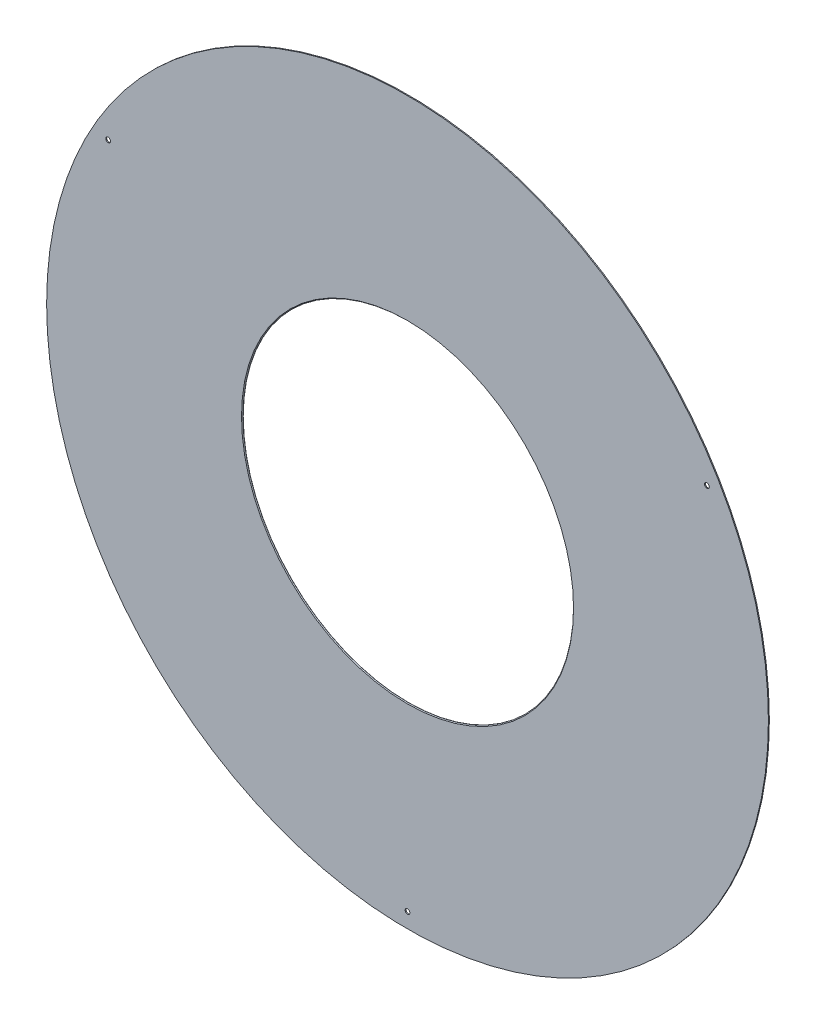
from build123d import *

# Parameters (mm, degrees)
SKETCH1_R                      = 603.25
SKETCH1_R_2                    = 276.225
BOSS_EXTRUDE1_DEPTH            = 1.5875
CHAMFER1_SIZE                  = 1.27
F_5_16_0_3125_DIAMETER_HOLE1_D = 7.9375
CIRPATTERN1_COUNT              = 3


with BuildPart() as part:
    # Sketch1 → Boss-Extrude1 (new body)
    with BuildSketch(Plane.XY):
        Circle(SKETCH1_R)
        Circle(SKETCH1_R_2, mode=Mode.SUBTRACT)
    extrude(amount=BOSS_EXTRUDE1_DEPTH)

    # Chamfer1
    chamfer1_edges = [part.edges().sort_by_distance(p)[0] for p in [
        (-276.225, 0, 1.5875),
    ]]
    chamfer(chamfer1_edges, length=CHAMFER1_SIZE)

    # 5_16 _0.3125_ Diameter Hole1 (through all)
    with Locations(Plane.XY.offset(1.5875)):
        with Locations((0, -577.85)):
            f_5_16_0_3125_diameter_hole1 = Hole(F_5_16_0_3125_DIAMETER_HOLE1_D / 2)

    # CirPattern1: 5_16 _0.3125_ Diameter Hole1 ×3 about axis
    cirpattern1_axis = Axis((0, 0, 0), (0, 0, 1))
    for i in range(1, CIRPATTERN1_COUNT):
        add(f_5_16_0_3125_diameter_hole1.rotate(cirpattern1_axis, i * 360 / CIRPATTERN1_COUNT), mode=Mode.SUBTRACT)


solid = part.part
